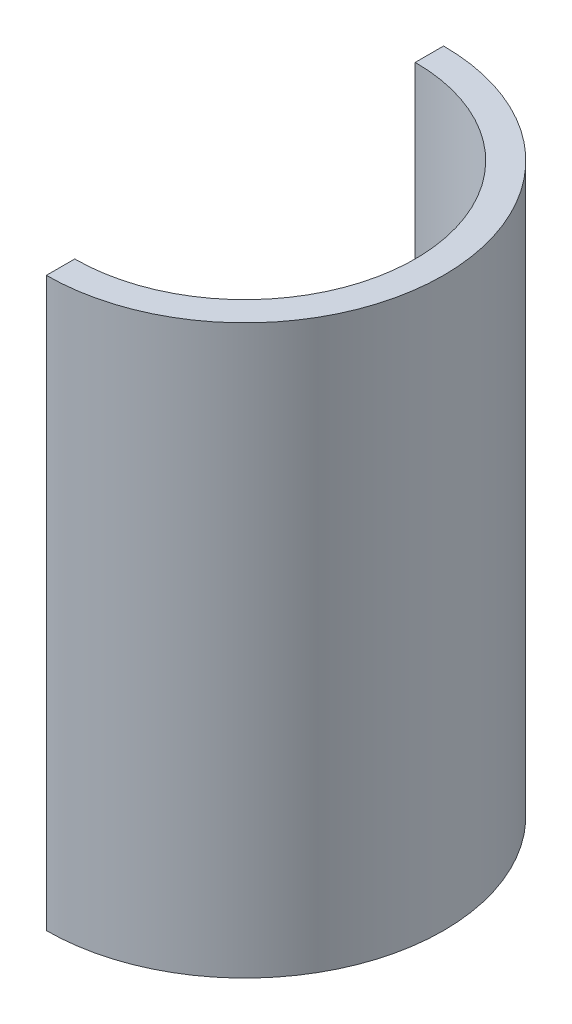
from build123d import *

# Parameters (mm, degrees)
SKETCH1_W      = 2.5
SKETCH1_H      = 50
REVOLVE1_ANGLE = 180


with BuildPart() as part:
    # Sketch1 → Revolve1 (revolve)
    with BuildSketch(Plane(origin=(0, 0, 0), x_dir=(0, 0, -1), z_dir=(1, 0, 0))):
        with Locations((16.25, 0)):
            Rectangle(SKETCH1_W, SKETCH1_H)
    revolve(axis=Axis((0, 0, 0), (0, -1, 0)), revolution_arc=REVOLVE1_ANGLE)


solid = part.part
